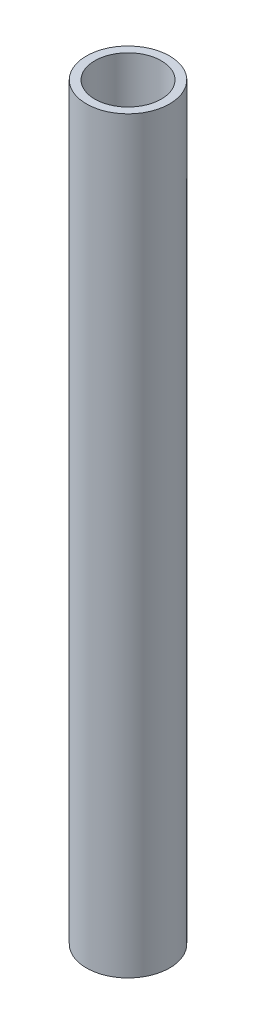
ISO-10303-21;
HEADER;
FILE_DESCRIPTION(('STEP AP214'),'2;1');
FILE_NAME('part.step','',(''),(''),'','','');
FILE_SCHEMA(('AUTOMOTIVE_DESIGN { 1 0 10303 214 1 1 1 1 }'));
ENDSEC;
DATA;
#1=APPLICATION_CONTEXT('core data for automotive mechanical design processes');
#2=APPLICATION_PROTOCOL_DEFINITION('international standard','automotive_design',2000,#1);
#3=PRODUCT_CONTEXT('',#1,'mechanical');
#4=PRODUCT('Part','Part','',(#3));
#5=PRODUCT_RELATED_PRODUCT_CATEGORY('part','',(#4));
#6=PRODUCT_DEFINITION_FORMATION('','',#4);
#7=PRODUCT_DEFINITION_CONTEXT('part definition',#1,'design');
#8=PRODUCT_DEFINITION('design','',#6,#7);
#9=PRODUCT_DEFINITION_SHAPE('','',#8);
#10=(LENGTH_UNIT() NAMED_UNIT(*) SI_UNIT(.MILLI.,.METRE.));
#11=(NAMED_UNIT(*) PLANE_ANGLE_UNIT() SI_UNIT($,.RADIAN.));
#12=(NAMED_UNIT(*) SI_UNIT($,.STERADIAN.) SOLID_ANGLE_UNIT());
#13=UNCERTAINTY_MEASURE_WITH_UNIT(LENGTH_MEASURE(1.E-05),#10,'distance_accuracy_value','');
#14=(GEOMETRIC_REPRESENTATION_CONTEXT(3) GLOBAL_UNCERTAINTY_ASSIGNED_CONTEXT((#13)) GLOBAL_UNIT_ASSIGNED_CONTEXT((#10,
#11,#12)) REPRESENTATION_CONTEXT('',''));
#15=CARTESIAN_POINT('',(0.,0.,0.));
#16=DIRECTION('',(0.,0.,1.));
#17=DIRECTION('',(1.,0.,0.));
#18=AXIS2_PLACEMENT_3D('',#15,#16,#17);
#19=CARTESIAN_POINT('',(0.,180.,0.));
#20=DIRECTION('',(0.,-1.,0.));
#21=DIRECTION('',(0.,0.,-1.));
#22=AXIS2_PLACEMENT_3D('',#19,#20,#21);
#23=CYLINDRICAL_SURFACE('',#22,10.);
#24=CARTESIAN_POINT('',(0.,180.,0.));
#25=DIRECTION('',(0.,1.,0.));
#26=DIRECTION('',(0.,0.,1.));
#27=AXIS2_PLACEMENT_3D('',#24,#25,#26);
#28=CIRCLE('',#27,10.);
#29=CARTESIAN_POINT('',(0.,180.,-10.));
#30=VERTEX_POINT('',#29);
#31=EDGE_CURVE('E10',#30,#30,#28,.T.);
#32=CARTESIAN_POINT('',(0.,0.,0.));
#33=DIRECTION('',(0.,1.,0.));
#34=DIRECTION('',(0.,0.,1.));
#35=AXIS2_PLACEMENT_3D('',#32,#33,#34);
#36=CIRCLE('',#35,10.);
#37=CARTESIAN_POINT('',(0.,0.,-10.));
#38=VERTEX_POINT('',#37);
#39=EDGE_CURVE('E38',#38,#38,#36,.T.);
#40=CARTESIAN_POINT('',(0.,180.,-10.));
#41=CARTESIAN_POINT('',(0.,178.125,-10.));
#42=CARTESIAN_POINT('',(0.,176.25,-10.));
#43=CARTESIAN_POINT('',(0.,172.5,-10.));
#44=CARTESIAN_POINT('',(0.,170.625,-10.));
#45=CARTESIAN_POINT('',(0.,166.875,-10.));
#46=CARTESIAN_POINT('',(0.,165.,-10.));
#47=CARTESIAN_POINT('',(0.,161.25,-10.));
#48=CARTESIAN_POINT('',(0.,159.375,-10.));
#49=CARTESIAN_POINT('',(0.,155.625,-10.));
#50=CARTESIAN_POINT('',(0.,153.75,-10.));
#51=CARTESIAN_POINT('',(0.,150.,-10.));
#52=CARTESIAN_POINT('',(0.,148.125,-10.));
#53=CARTESIAN_POINT('',(0.,144.375,-10.));
#54=CARTESIAN_POINT('',(0.,142.5,-10.));
#55=CARTESIAN_POINT('',(0.,138.75,-10.));
#56=CARTESIAN_POINT('',(0.,136.875,-10.));
#57=CARTESIAN_POINT('',(0.,133.125,-10.));
#58=CARTESIAN_POINT('',(0.,131.25,-10.));
#59=CARTESIAN_POINT('',(0.,127.5,-10.));
#60=CARTESIAN_POINT('',(0.,125.625,-10.));
#61=CARTESIAN_POINT('',(0.,121.875,-10.));
#62=CARTESIAN_POINT('',(0.,120.,-10.));
#63=CARTESIAN_POINT('',(0.,116.25,-10.));
#64=CARTESIAN_POINT('',(0.,114.375,-10.));
#65=CARTESIAN_POINT('',(0.,110.625,-10.));
#66=CARTESIAN_POINT('',(0.,108.75,-10.));
#67=CARTESIAN_POINT('',(0.,105.,-10.));
#68=CARTESIAN_POINT('',(0.,103.125,-10.));
#69=CARTESIAN_POINT('',(0.,99.375,-10.));
#70=CARTESIAN_POINT('',(0.,97.5,-10.));
#71=CARTESIAN_POINT('',(0.,93.75,-10.));
#72=CARTESIAN_POINT('',(0.,91.875,-10.));
#73=CARTESIAN_POINT('',(0.,88.125,-10.));
#74=CARTESIAN_POINT('',(0.,86.25,-10.));
#75=CARTESIAN_POINT('',(0.,82.5,-10.));
#76=CARTESIAN_POINT('',(0.,80.625,-10.));
#77=CARTESIAN_POINT('',(0.,76.875,-10.));
#78=CARTESIAN_POINT('',(0.,75.,-10.));
#79=CARTESIAN_POINT('',(0.,71.25,-10.));
#80=CARTESIAN_POINT('',(0.,69.375,-10.));
#81=CARTESIAN_POINT('',(0.,65.625,-10.));
#82=CARTESIAN_POINT('',(0.,63.75,-10.));
#83=CARTESIAN_POINT('',(0.,60.,-10.));
#84=CARTESIAN_POINT('',(0.,58.125,-10.));
#85=CARTESIAN_POINT('',(0.,54.375,-10.));
#86=CARTESIAN_POINT('',(0.,52.5,-10.));
#87=CARTESIAN_POINT('',(0.,48.75,-10.));
#88=CARTESIAN_POINT('',(0.,46.875,-10.));
#89=CARTESIAN_POINT('',(0.,43.125,-10.));
#90=CARTESIAN_POINT('',(0.,41.25,-10.));
#91=CARTESIAN_POINT('',(0.,37.5,-10.));
#92=CARTESIAN_POINT('',(0.,35.625,-10.));
#93=CARTESIAN_POINT('',(0.,31.875,-10.));
#94=CARTESIAN_POINT('',(0.,30.,-10.));
#95=CARTESIAN_POINT('',(0.,26.25,-10.));
#96=CARTESIAN_POINT('',(0.,24.375,-10.));
#97=CARTESIAN_POINT('',(0.,20.625,-10.));
#98=CARTESIAN_POINT('',(0.,18.75,-10.));
#99=CARTESIAN_POINT('',(0.,15.,-10.));
#100=CARTESIAN_POINT('',(0.,13.125,-10.));
#101=CARTESIAN_POINT('',(0.,9.37499999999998,-10.));
#102=CARTESIAN_POINT('',(0.,7.49999999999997,-10.));
#103=CARTESIAN_POINT('',(0.,3.74999999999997,-10.));
#104=CARTESIAN_POINT('',(0.,1.87499999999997,-10.));
#105=CARTESIAN_POINT('',(0.,0.,-10.));
#106=B_SPLINE_CURVE_WITH_KNOTS('',3,(#40,#41,#42,#43,#44,#45,#46,#47,#48,#49,#50,#51,#52,#53,
#54,#55,#56,#57,#58,#59,#60,#61,#62,#63,#64,#65,#66,#67,#68,#69,#70,#71,#72,#73,#74,#75,#76,#77,
#78,#79,#80,#81,#82,#83,#84,#85,#86,#87,#88,#89,#90,#91,#92,#93,#94,#95,#96,#97,#98,#99,#100,
#101,#102,#103,#104,#105),.UNSPECIFIED.,.F.,.F.,(4,2,2,2,2,2,2,2,2,2,2,2,2,2,2,2,2,2,2,2,2,2,2,
2,2,2,2,2,2,2,2,2,4),(0.,5.62499999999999,11.25,16.875,22.5,28.125,33.75,39.375,45.,50.625,
56.25,61.875,67.5,73.125,78.75,84.375,90.,95.625,101.25,106.875,112.5,118.125,123.75,129.375,
135.,140.625,146.25,151.875,157.5,163.125,168.75,174.375,180.),.UNSPECIFIED.);
#107=EDGE_CURVE('BSEAM35',#30,#38,#106,.T.);
#108=ORIENTED_EDGE('',*,*,#31,.F.);
#109=ORIENTED_EDGE('',*,*,#39,.T.);
#110=ORIENTED_EDGE('',*,*,#107,.T.);
#111=ORIENTED_EDGE('',*,*,#107,.F.);
#112=EDGE_LOOP('',(#108,#110,#109,#111));
#113=FACE_BOUND('',#112,.T.);
#114=ADVANCED_FACE('F35',(#113),#23,.T.);
#115=CARTESIAN_POINT('',(0.,180.,0.));
#116=DIRECTION('',(0.,1.,0.));
#117=DIRECTION('',(0.,0.,1.));
#118=AXIS2_PLACEMENT_3D('',#115,#116,#117);
#119=PLANE('',#118);
#120=CARTESIAN_POINT('',(0.,180.,0.));
#121=DIRECTION('',(0.,1.,0.));
#122=DIRECTION('',(0.,0.,1.));
#123=AXIS2_PLACEMENT_3D('',#120,#121,#122);
#124=CIRCLE('',#123,8.);
#125=CARTESIAN_POINT('',(0.,180.,8.));
#126=VERTEX_POINT('',#125);
#127=EDGE_CURVE('E47',#126,#126,#124,.T.);
#128=ORIENTED_EDGE('',*,*,#127,.F.);
#129=EDGE_LOOP('',(#128));
#130=FACE_BOUND('',#129,.T.);
#131=ORIENTED_EDGE('',*,*,#31,.T.);
#132=EDGE_LOOP('',(#131));
#133=FACE_BOUND('',#132,.T.);
#134=ADVANCED_FACE('F62',(#130,#133),#119,.T.);
#135=CARTESIAN_POINT('',(0.,0.,0.));
#136=DIRECTION('',(0.,1.,0.));
#137=DIRECTION('',(0.,0.,1.));
#138=AXIS2_PLACEMENT_3D('',#135,#136,#137);
#139=PLANE('',#138);
#140=CARTESIAN_POINT('',(0.,0.,0.));
#141=DIRECTION('',(0.,1.,0.));
#142=DIRECTION('',(0.,0.,1.));
#143=AXIS2_PLACEMENT_3D('',#140,#141,#142);
#144=CIRCLE('',#143,8.);
#145=CARTESIAN_POINT('',(0.,0.,8.));
#146=VERTEX_POINT('',#145);
#147=EDGE_CURVE('E45',#146,#146,#144,.T.);
#148=ORIENTED_EDGE('',*,*,#147,.T.);
#149=EDGE_LOOP('',(#148));
#150=FACE_BOUND('',#149,.T.);
#151=ORIENTED_EDGE('',*,*,#39,.F.);
#152=EDGE_LOOP('',(#151));
#153=FACE_BOUND('',#152,.T.);
#154=ADVANCED_FACE('F53',(#150,#153),#139,.F.);
#155=CARTESIAN_POINT('',(0.,0.,0.));
#156=DIRECTION('',(0.,1.,0.));
#157=DIRECTION('',(0.,0.,1.));
#158=AXIS2_PLACEMENT_3D('',#155,#156,#157);
#159=CYLINDRICAL_SURFACE('',#158,8.);
#160=CARTESIAN_POINT('',(0.,0.,8.));
#161=CARTESIAN_POINT('',(0.,1.875,8.));
#162=CARTESIAN_POINT('',(0.,3.75,8.));
#163=CARTESIAN_POINT('',(0.,7.5,8.));
#164=CARTESIAN_POINT('',(0.,9.375,8.));
#165=CARTESIAN_POINT('',(0.,13.125,8.));
#166=CARTESIAN_POINT('',(0.,15.,8.));
#167=CARTESIAN_POINT('',(0.,18.75,8.));
#168=CARTESIAN_POINT('',(0.,20.625,8.));
#169=CARTESIAN_POINT('',(0.,24.375,8.));
#170=CARTESIAN_POINT('',(0.,26.25,8.));
#171=CARTESIAN_POINT('',(0.,30.,8.));
#172=CARTESIAN_POINT('',(0.,31.875,8.));
#173=CARTESIAN_POINT('',(0.,35.625,8.));
#174=CARTESIAN_POINT('',(0.,37.5,8.));
#175=CARTESIAN_POINT('',(0.,41.25,8.));
#176=CARTESIAN_POINT('',(0.,43.125,8.));
#177=CARTESIAN_POINT('',(0.,46.875,8.));
#178=CARTESIAN_POINT('',(0.,48.75,8.));
#179=CARTESIAN_POINT('',(0.,52.5,8.));
#180=CARTESIAN_POINT('',(0.,54.375,8.));
#181=CARTESIAN_POINT('',(0.,58.125,8.));
#182=CARTESIAN_POINT('',(0.,60.,8.));
#183=CARTESIAN_POINT('',(0.,63.75,8.));
#184=CARTESIAN_POINT('',(0.,65.625,8.));
#185=CARTESIAN_POINT('',(0.,69.375,8.));
#186=CARTESIAN_POINT('',(0.,71.25,8.));
#187=CARTESIAN_POINT('',(0.,75.,8.));
#188=CARTESIAN_POINT('',(0.,76.875,8.));
#189=CARTESIAN_POINT('',(0.,80.625,8.));
#190=CARTESIAN_POINT('',(0.,82.5,8.));
#191=CARTESIAN_POINT('',(0.,86.25,8.));
#192=CARTESIAN_POINT('',(0.,88.125,8.));
#193=CARTESIAN_POINT('',(0.,91.875,8.));
#194=CARTESIAN_POINT('',(0.,93.75,8.));
#195=CARTESIAN_POINT('',(0.,97.5,8.));
#196=CARTESIAN_POINT('',(0.,99.375,8.));
#197=CARTESIAN_POINT('',(0.,103.125,8.));
#198=CARTESIAN_POINT('',(0.,105.,8.));
#199=CARTESIAN_POINT('',(0.,108.75,8.));
#200=CARTESIAN_POINT('',(0.,110.625,8.));
#201=CARTESIAN_POINT('',(0.,114.375,8.));
#202=CARTESIAN_POINT('',(0.,116.25,8.));
#203=CARTESIAN_POINT('',(0.,120.,8.));
#204=CARTESIAN_POINT('',(0.,121.875,8.));
#205=CARTESIAN_POINT('',(0.,125.625,8.));
#206=CARTESIAN_POINT('',(0.,127.5,8.));
#207=CARTESIAN_POINT('',(0.,131.25,8.));
#208=CARTESIAN_POINT('',(0.,133.125,8.));
#209=CARTESIAN_POINT('',(0.,136.875,8.));
#210=CARTESIAN_POINT('',(0.,138.75,8.));
#211=CARTESIAN_POINT('',(0.,142.5,8.));
#212=CARTESIAN_POINT('',(0.,144.375,8.));
#213=CARTESIAN_POINT('',(0.,148.125,8.));
#214=CARTESIAN_POINT('',(0.,150.,8.));
#215=CARTESIAN_POINT('',(0.,153.75,8.));
#216=CARTESIAN_POINT('',(0.,155.625,8.));
#217=CARTESIAN_POINT('',(0.,159.375,8.));
#218=CARTESIAN_POINT('',(0.,161.25,8.));
#219=CARTESIAN_POINT('',(0.,165.,8.));
#220=CARTESIAN_POINT('',(0.,166.875,8.));
#221=CARTESIAN_POINT('',(0.,170.625,8.));
#222=CARTESIAN_POINT('',(0.,172.5,8.));
#223=CARTESIAN_POINT('',(0.,176.25,8.));
#224=CARTESIAN_POINT('',(0.,178.125,8.));
#225=CARTESIAN_POINT('',(0.,180.,8.));
#226=B_SPLINE_CURVE_WITH_KNOTS('',3,(#160,#161,#162,#163,#164,#165,#166,#167,#168,#169,#170,
#171,#172,#173,#174,#175,#176,#177,#178,#179,#180,#181,#182,#183,#184,#185,#186,#187,#188,#189,
#190,#191,#192,#193,#194,#195,#196,#197,#198,#199,#200,#201,#202,#203,#204,#205,#206,#207,#208,
#209,#210,#211,#212,#213,#214,#215,#216,#217,#218,#219,#220,#221,#222,#223,#224,#225),
.UNSPECIFIED.,.F.,.F.,(4,2,2,2,2,2,2,2,2,2,2,2,2,2,2,2,2,2,2,2,2,2,2,2,2,2,2,2,2,2,2,2,4),(0.,
5.625,11.25,16.875,22.5,28.125,33.75,39.375,45.,50.625,56.25,61.875,67.5,73.125,78.75,84.375,
90.,95.625,101.25,106.875,112.5,118.125,123.75,129.375,135.,140.625,146.25,151.875,157.5,
163.125,168.75,174.375,180.),.UNSPECIFIED.);
#227=EDGE_CURVE('BSEAM56',#146,#126,#226,.T.);
#228=ORIENTED_EDGE('',*,*,#147,.F.);
#229=ORIENTED_EDGE('',*,*,#127,.T.);
#230=ORIENTED_EDGE('',*,*,#227,.T.);
#231=ORIENTED_EDGE('',*,*,#227,.F.);
#232=EDGE_LOOP('',(#228,#230,#229,#231));
#233=FACE_BOUND('',#232,.T.);
#234=ADVANCED_FACE('F56',(#233),#159,.F.);
#235=CLOSED_SHELL('',(#114,#134,#154,#234));
#236=MANIFOLD_SOLID_BREP('B2',#235);
#237=ADVANCED_BREP_SHAPE_REPRESENTATION('',(#18,#236),#14);
#238=SHAPE_DEFINITION_REPRESENTATION(#9,#237);
ENDSEC;
END-ISO-10303-21;
